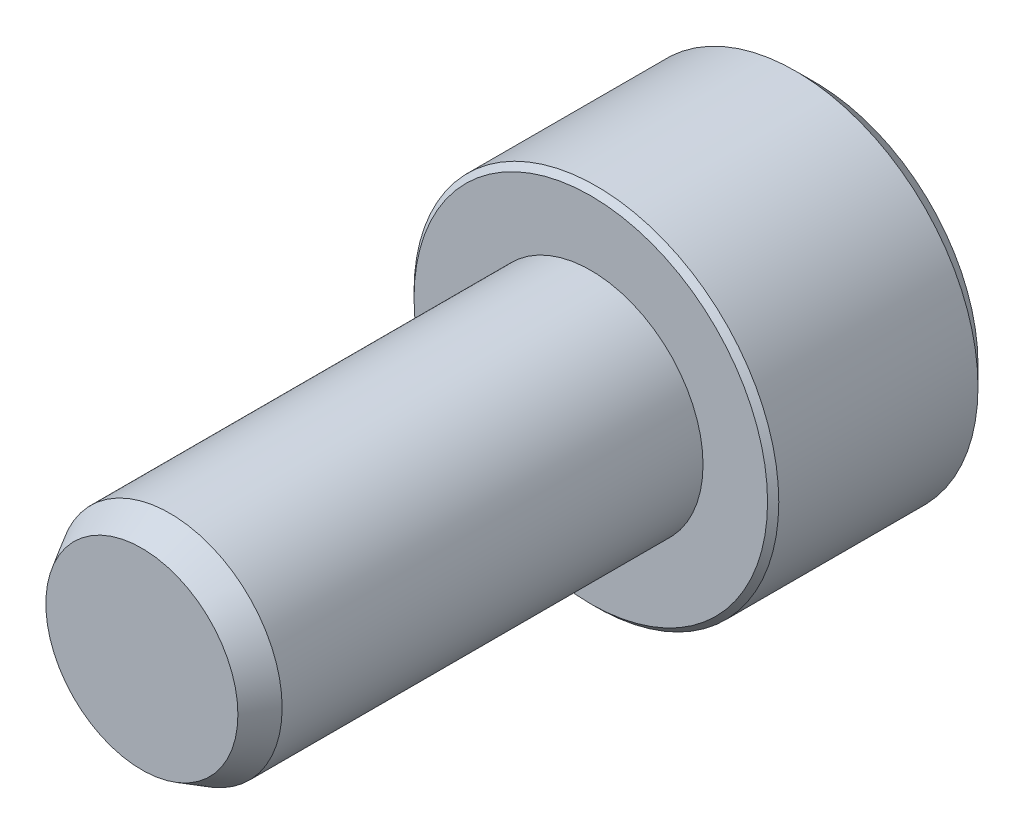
from build123d import *

# Parameters (mm, degrees)
ESQUISSE1_R             = 4
BASE_EXTRUSION_DEPTH    = 16
ESQUISSE2_R             = 6.5
BOSS_EXTRU_1_DEPTH      = 8
ENL_V_MAT_EXTRU_1_DEPTH = 4.5
CHANFREIN1_SIZE         = 0.7
CHANFREIN2_SIZE         = 1
CHANFREIN2_SIZE2        = 0.577350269
CHANFREIN3_SIZE         = 0.2


with BuildPart() as part:
    # Esquisse1 → Base-Extrusion (new body)
    with BuildSketch(Plane.XY):
        Circle(ESQUISSE1_R)
    extrude(amount=BASE_EXTRUSION_DEPTH)

    # Esquisse2 → Boss.-Extru.1 (add)
    with BuildSketch(Plane.XY):
        Circle(ESQUISSE2_R)
    extrude(amount=-BOSS_EXTRU_1_DEPTH)

    # Esquisse3 → Enl_v. mat.-Extru.1 (cut)
    with BuildSketch(Plane(origin=(0, 0, -8), x_dir=(-1, 0, 0), z_dir=(0, 0, -1))):
        Polygon((3.464101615, 0), (1.732050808, 3), (-1.732050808, 3), (-3.464101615, 0), (-1.732050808, -3), (1.732050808, -3), align=None)
    extrude(amount=-ENL_V_MAT_EXTRU_1_DEPTH, mode=Mode.SUBTRACT)

    # Chanfrein1
    chanfrein1_edges = [part.edges().sort_by_distance(p)[0] for p in [
        (-6.5, 0, -8),
    ]]
    chamfer(chanfrein1_edges, length=CHANFREIN1_SIZE)

    # Chanfrein2
    chanfrein2_edges = [part.edges().sort_by_distance(p)[0] for p in [
        (-4, 0, 16),
    ]]
    chanfrein2_side = [part.faces().sort_by_distance(p)[0] for p in [
        (-4, 0, 8),
    ]]
    chamfer(chanfrein2_edges, length=CHANFREIN2_SIZE, length2=CHANFREIN2_SIZE2, reference=chanfrein2_side[0])

    # Chanfrein3
    chanfrein3_edges = [part.edges().sort_by_distance(p)[0] for p in [
        (-6.5, 0, 0),
    ]]
    chamfer(chanfrein3_edges, length=CHANFREIN3_SIZE)


solid = part.part
